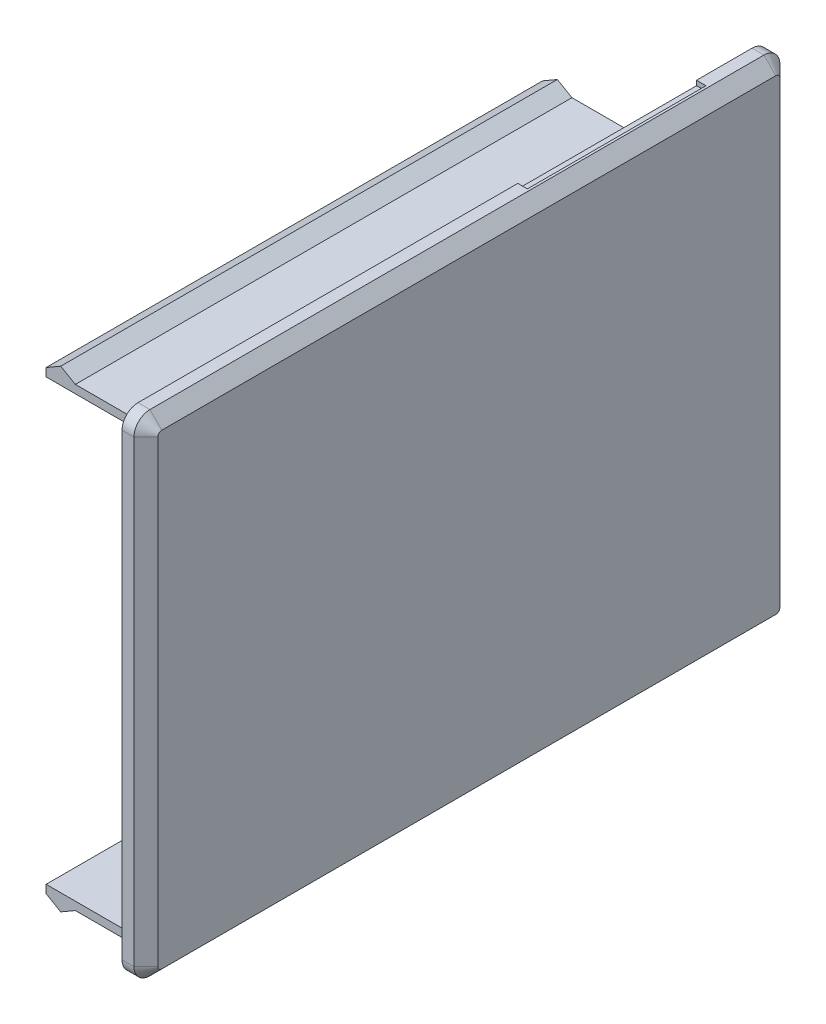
ISO-10303-21;
HEADER;
FILE_DESCRIPTION(('STEP AP214'),'2;1');
FILE_NAME('part.step','',(''),(''),'','','');
FILE_SCHEMA(('AUTOMOTIVE_DESIGN { 1 0 10303 214 1 1 1 1 }'));
ENDSEC;
DATA;
#1=APPLICATION_CONTEXT('core data for automotive mechanical design processes');
#2=APPLICATION_PROTOCOL_DEFINITION('international standard','automotive_design',2000,#1);
#3=PRODUCT_CONTEXT('',#1,'mechanical');
#4=PRODUCT('Part','Part','',(#3));
#5=PRODUCT_RELATED_PRODUCT_CATEGORY('part','',(#4));
#6=PRODUCT_DEFINITION_FORMATION('','',#4);
#7=PRODUCT_DEFINITION_CONTEXT('part definition',#1,'design');
#8=PRODUCT_DEFINITION('design','',#6,#7);
#9=PRODUCT_DEFINITION_SHAPE('','',#8);
#10=(LENGTH_UNIT() NAMED_UNIT(*) SI_UNIT(.MILLI.,.METRE.));
#11=(NAMED_UNIT(*) PLANE_ANGLE_UNIT() SI_UNIT($,.RADIAN.));
#12=(NAMED_UNIT(*) SI_UNIT($,.STERADIAN.) SOLID_ANGLE_UNIT());
#13=UNCERTAINTY_MEASURE_WITH_UNIT(LENGTH_MEASURE(1.E-05),#10,'distance_accuracy_value','');
#14=(GEOMETRIC_REPRESENTATION_CONTEXT(3) GLOBAL_UNCERTAINTY_ASSIGNED_CONTEXT((#13)) GLOBAL_UNIT_ASSIGNED_CONTEXT((#10,
#11,#12)) REPRESENTATION_CONTEXT('',''));
#15=CARTESIAN_POINT('',(0.,0.,0.));
#16=DIRECTION('',(0.,0.,1.));
#17=DIRECTION('',(1.,0.,0.));
#18=AXIS2_PLACEMENT_3D('',#15,#16,#17);
#19=CARTESIAN_POINT('',(0.,0.,0.));
#20=DIRECTION('',(-1.,0.,0.));
#21=DIRECTION('',(0.,0.,1.));
#22=AXIS2_PLACEMENT_3D('',#19,#20,#21);
#23=PLANE('',#22);
#24=DIRECTION('',(0.,0.,-1.));
#25=VECTOR('',#24,1.);
#26=CARTESIAN_POINT('',(0.,50.43,-1.89999999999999));
#27=LINE('',#26,#25);
#28=CARTESIAN_POINT('',(0.,50.43,-1.89999999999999));
#29=VERTEX_POINT('',#28);
#30=CARTESIAN_POINT('',(0.,50.43,-67.539999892));
#31=VERTEX_POINT('',#30);
#32=EDGE_CURVE('E399',#29,#31,#27,.T.);
#33=ORIENTED_EDGE('',*,*,#32,.F.);
#34=DIRECTION('',(0.,1.,0.));
#35=VECTOR('',#34,1.);
#36=CARTESIAN_POINT('',(0.,50.43,-1.89999999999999));
#37=LINE('',#36,#35);
#38=CARTESIAN_POINT('',(0.,1.85,-1.89999999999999));
#39=VERTEX_POINT('',#38);
#40=EDGE_CURVE('E388',#39,#29,#37,.T.);
#41=ORIENTED_EDGE('',*,*,#40,.F.);
#42=DIRECTION('',(0.,0.,1.));
#43=VECTOR('',#42,1.);
#44=CARTESIAN_POINT('',(0.,1.85,-1.89999999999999));
#45=LINE('',#44,#43);
#46=CARTESIAN_POINT('',(0.,1.85,-67.539999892));
#47=VERTEX_POINT('',#46);
#48=EDGE_CURVE('E392',#47,#39,#45,.T.);
#49=ORIENTED_EDGE('',*,*,#48,.F.);
#50=DIRECTION('',(0.,-1.,0.));
#51=VECTOR('',#50,1.);
#52=CARTESIAN_POINT('',(0.,50.43,-67.539999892));
#53=LINE('',#52,#51);
#54=EDGE_CURVE('E403',#31,#47,#53,.T.);
#55=ORIENTED_EDGE('',*,*,#54,.F.);
#56=EDGE_LOOP('',(#33,#41,#49,#55));
#57=FACE_BOUND('',#56,.T.);
#58=DIRECTION('',(0.,0.,-1.));
#59=VECTOR('',#58,1.);
#60=CARTESIAN_POINT('',(0.,0.508000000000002,-42.19));
#61=LINE('',#60,#59);
#62=CARTESIAN_POINT('',(0.,0.508000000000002,-42.19));
#63=VERTEX_POINT('',#62);
#64=CARTESIAN_POINT('',(0.,0.508000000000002,-61.24));
#65=VERTEX_POINT('',#64);
#66=EDGE_CURVE('E562',#63,#65,#61,.T.);
#67=ORIENTED_EDGE('',*,*,#66,.F.);
#68=DIRECTION('',(0.,-1.,0.));
#69=VECTOR('',#68,1.);
#70=CARTESIAN_POINT('',(0.,0.508000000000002,-42.19));
#71=LINE('',#70,#69);
#72=CARTESIAN_POINT('',(0.,0.,-42.19));
#73=VERTEX_POINT('',#72);
#74=EDGE_CURVE('E552',#63,#73,#71,.T.);
#75=ORIENTED_EDGE('',*,*,#74,.T.);
#76=DIRECTION('',(0.,0.,-1.));
#77=VECTOR('',#76,1.);
#78=CARTESIAN_POINT('',(0.,0.,0.));
#79=LINE('',#78,#77);
#80=CARTESIAN_POINT('',(0.,0.,-1.7));
#81=VERTEX_POINT('',#80);
#82=EDGE_CURVE('E422',#81,#73,#79,.T.);
#83=ORIENTED_EDGE('',*,*,#82,.F.);
#84=CARTESIAN_POINT('',(0.,1.7,-1.7));
#85=DIRECTION('',(-1.,0.,0.));
#86=DIRECTION('',(0.,0.,1.));
#87=AXIS2_PLACEMENT_3D('',#84,#85,#86);
#88=CIRCLE('',#87,1.7);
#89=CARTESIAN_POINT('',(0.,1.7,0.));
#90=VERTEX_POINT('',#89);
#91=EDGE_CURVE('E445',#81,#90,#88,.T.);
#92=ORIENTED_EDGE('',*,*,#91,.T.);
#93=DIRECTION('',(0.,-1.,0.));
#94=VECTOR('',#93,1.);
#95=CARTESIAN_POINT('',(0.,0.,0.));
#96=LINE('',#95,#94);
#97=CARTESIAN_POINT('',(0.,50.58,0.));
#98=VERTEX_POINT('',#97);
#99=EDGE_CURVE('E418',#98,#90,#96,.T.);
#100=ORIENTED_EDGE('',*,*,#99,.F.);
#101=CARTESIAN_POINT('',(0.,50.58,-1.7));
#102=DIRECTION('',(-1.,0.,0.));
#103=DIRECTION('',(0.,0.,1.));
#104=AXIS2_PLACEMENT_3D('',#101,#102,#103);
#105=CIRCLE('',#104,1.7);
#106=CARTESIAN_POINT('',(0.,52.28,-1.7));
#107=VERTEX_POINT('',#106);
#108=EDGE_CURVE('E447',#98,#107,#105,.T.);
#109=ORIENTED_EDGE('',*,*,#108,.T.);
#110=DIRECTION('',(0.,0.,1.));
#111=VECTOR('',#110,1.);
#112=CARTESIAN_POINT('',(0.,52.28,0.));
#113=LINE('',#112,#111);
#114=CARTESIAN_POINT('',(0.,52.28,-42.19));
#115=VERTEX_POINT('',#114);
#116=EDGE_CURVE('E430',#115,#107,#113,.T.);
#117=ORIENTED_EDGE('',*,*,#116,.F.);
#118=DIRECTION('',(0.,1.,0.));
#119=VECTOR('',#118,1.);
#120=CARTESIAN_POINT('',(0.,51.772,-42.19));
#121=LINE('',#120,#119);
#122=CARTESIAN_POINT('',(0.,51.772,-42.19));
#123=VERTEX_POINT('',#122);
#124=EDGE_CURVE('E608',#123,#115,#121,.T.);
#125=ORIENTED_EDGE('',*,*,#124,.F.);
#126=DIRECTION('',(0.,0.,-1.));
#127=VECTOR('',#126,1.);
#128=CARTESIAN_POINT('',(0.,51.772,-42.19));
#129=LINE('',#128,#127);
#130=CARTESIAN_POINT('',(0.,51.772,-61.24));
#131=VERTEX_POINT('',#130);
#132=EDGE_CURVE('E634',#123,#131,#129,.T.);
#133=ORIENTED_EDGE('',*,*,#132,.T.);
#134=DIRECTION('',(0.,1.,0.));
#135=VECTOR('',#134,1.);
#136=CARTESIAN_POINT('',(0.,51.772,-61.24));
#137=LINE('',#136,#135);
#138=CARTESIAN_POINT('',(0.,52.28,-61.24));
#139=VERTEX_POINT('',#138);
#140=EDGE_CURVE('E577',#131,#139,#137,.T.);
#141=ORIENTED_EDGE('',*,*,#140,.T.);
#142=CARTESIAN_POINT('',(0.,52.28,-67.16));
#143=VERTEX_POINT('',#142);
#144=EDGE_CURVE('E431',#143,#139,#113,.T.);
#145=ORIENTED_EDGE('',*,*,#144,.F.);
#146=CARTESIAN_POINT('',(0.,50.58,-67.16));
#147=DIRECTION('',(-1.,0.,0.));
#148=DIRECTION('',(0.,0.,1.));
#149=AXIS2_PLACEMENT_3D('',#146,#147,#148);
#150=CIRCLE('',#149,1.7);
#151=CARTESIAN_POINT('',(0.,50.58,-68.86));
#152=VERTEX_POINT('',#151);
#153=EDGE_CURVE('E443',#143,#152,#150,.T.);
#154=ORIENTED_EDGE('',*,*,#153,.T.);
#155=DIRECTION('',(0.,1.,0.));
#156=VECTOR('',#155,1.);
#157=CARTESIAN_POINT('',(0.,0.,-68.86));
#158=LINE('',#157,#156);
#159=CARTESIAN_POINT('',(0.,1.7,-68.86));
#160=VERTEX_POINT('',#159);
#161=EDGE_CURVE('E426',#160,#152,#158,.T.);
#162=ORIENTED_EDGE('',*,*,#161,.F.);
#163=CARTESIAN_POINT('',(0.,1.7,-67.16));
#164=DIRECTION('',(-1.,0.,0.));
#165=DIRECTION('',(0.,0.,1.));
#166=AXIS2_PLACEMENT_3D('',#163,#164,#165);
#167=CIRCLE('',#166,1.7);
#168=CARTESIAN_POINT('',(0.,0.,-67.16));
#169=VERTEX_POINT('',#168);
#170=EDGE_CURVE('E439',#160,#169,#167,.T.);
#171=ORIENTED_EDGE('',*,*,#170,.T.);
#172=CARTESIAN_POINT('',(0.,0.,-61.24));
#173=VERTEX_POINT('',#172);
#174=EDGE_CURVE('E421',#173,#169,#79,.T.);
#175=ORIENTED_EDGE('',*,*,#174,.F.);
#176=DIRECTION('',(0.,-1.,0.));
#177=VECTOR('',#176,1.);
#178=CARTESIAN_POINT('',(0.,0.508000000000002,-61.24));
#179=LINE('',#178,#177);
#180=EDGE_CURVE('E528',#65,#173,#179,.T.);
#181=ORIENTED_EDGE('',*,*,#180,.F.);
#182=EDGE_LOOP('',(#67,#75,#83,#92,#100,#109,#117,#125,#133,#141,#145,#154,#162,#171,#175,#181));
#183=FACE_BOUND('',#182,.T.);
#184=ADVANCED_FACE('F62',(#57,#183),#23,.T.);
#185=CARTESIAN_POINT('',(2.54,0.,0.));
#186=DIRECTION('',(0.,1.,0.));
#187=DIRECTION('',(0.,0.,1.));
#188=AXIS2_PLACEMENT_3D('',#185,#186,#187);
#189=PLANE('',#188);
#190=DIRECTION('',(-1.,0.,0.));
#191=VECTOR('',#190,1.);
#192=CARTESIAN_POINT('',(2.54,0.,-67.16));
#193=LINE('',#192,#191);
#194=CARTESIAN_POINT('',(1.26999999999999,0.,-67.16));
#195=VERTEX_POINT('',#194);
#196=EDGE_CURVE('E454',#169,#195,#193,.F.);
#197=ORIENTED_EDGE('',*,*,#196,.T.);
#198=DIRECTION('',(0.,0.,1.));
#199=VECTOR('',#198,1.);
#200=CARTESIAN_POINT('',(1.26999999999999,0.,0.));
#201=LINE('',#200,#199);
#202=CARTESIAN_POINT('',(1.26999999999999,0.,-1.7));
#203=VERTEX_POINT('',#202);
#204=EDGE_CURVE('E486',#195,#203,#201,.T.);
#205=ORIENTED_EDGE('',*,*,#204,.T.);
#206=DIRECTION('',(-1.,0.,0.));
#207=VECTOR('',#206,1.);
#208=CARTESIAN_POINT('',(2.54,0.,-1.7));
#209=LINE('',#208,#207);
#210=EDGE_CURVE('E458',#203,#81,#209,.T.);
#211=ORIENTED_EDGE('',*,*,#210,.T.);
#212=ORIENTED_EDGE('',*,*,#82,.T.);
#213=DIRECTION('',(1.,0.,0.));
#214=VECTOR('',#213,1.);
#215=CARTESIAN_POINT('',(0.,0.,-42.19));
#216=LINE('',#215,#214);
#217=CARTESIAN_POINT('',(1.016,0.,-42.19));
#218=VERTEX_POINT('',#217);
#219=EDGE_CURVE('E544',#73,#218,#216,.T.);
#220=ORIENTED_EDGE('',*,*,#219,.T.);
#221=DIRECTION('',(0.,0.,-1.));
#222=VECTOR('',#221,1.);
#223=CARTESIAN_POINT('',(1.016,0.,-42.19));
#224=LINE('',#223,#222);
#225=CARTESIAN_POINT('',(1.016,0.,-61.24));
#226=VERTEX_POINT('',#225);
#227=EDGE_CURVE('E553',#218,#226,#224,.T.);
#228=ORIENTED_EDGE('',*,*,#227,.T.);
#229=DIRECTION('',(1.,0.,0.));
#230=VECTOR('',#229,1.);
#231=CARTESIAN_POINT('',(0.,0.,-61.24));
#232=LINE('',#231,#230);
#233=EDGE_CURVE('E549',#173,#226,#232,.T.);
#234=ORIENTED_EDGE('',*,*,#233,.F.);
#235=ORIENTED_EDGE('',*,*,#174,.T.);
#236=EDGE_LOOP('',(#197,#205,#211,#212,#220,#228,#234,#235));
#237=FACE_BOUND('',#236,.T.);
#238=ADVANCED_FACE('F680',(#237),#189,.F.);
#239=CARTESIAN_POINT('',(-0.762,0.,0.));
#240=DIRECTION('',(-1.,0.,0.));
#241=DIRECTION('',(0.,0.,1.));
#242=AXIS2_PLACEMENT_3D('',#239,#240,#241);
#243=PLANE('',#242);
#244=DIRECTION('',(0.,-1.,0.));
#245=VECTOR('',#244,1.);
#246=CARTESIAN_POINT('',(-0.762,50.43,-67.539999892));
#247=LINE('',#246,#245);
#248=CARTESIAN_POINT('',(-0.762,50.43,-67.539999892));
#249=VERTEX_POINT('',#248);
#250=CARTESIAN_POINT('',(-0.762000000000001,2.72000000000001,-67.539999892));
#251=VERTEX_POINT('',#250);
#252=EDGE_CURVE('E391',#249,#251,#247,.T.);
#253=ORIENTED_EDGE('',*,*,#252,.T.);
#254=DIRECTION('',(0.,0.,1.));
#255=VECTOR('',#254,1.);
#256=CARTESIAN_POINT('',(-0.762,2.72000000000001,-76.9405592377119));
#257=LINE('',#256,#255);
#258=CARTESIAN_POINT('',(-0.762,2.72000000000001,-66.669999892));
#259=VERTEX_POINT('',#258);
#260=EDGE_CURVE('E602',#251,#259,#257,.T.);
#261=ORIENTED_EDGE('',*,*,#260,.T.);
#262=DIRECTION('',(0.,-1.,0.));
#263=VECTOR('',#262,1.);
#264=CARTESIAN_POINT('',(-0.762,0.,-66.669999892));
#265=LINE('',#264,#263);
#266=CARTESIAN_POINT('',(-0.762,49.56,-66.669999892));
#267=VERTEX_POINT('',#266);
#268=EDGE_CURVE('E363',#267,#259,#265,.T.);
#269=ORIENTED_EDGE('',*,*,#268,.F.);
#270=DIRECTION('',(0.,0.,-1.));
#271=VECTOR('',#270,1.);
#272=CARTESIAN_POINT('',(-0.762,49.56,-67.539999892));
#273=LINE('',#272,#271);
#274=CARTESIAN_POINT('',(-0.761999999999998,49.56,-54.839999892));
#275=VERTEX_POINT('',#274);
#276=EDGE_CURVE('E331',#275,#267,#273,.T.);
#277=ORIENTED_EDGE('',*,*,#276,.F.);
#278=DIRECTION('',(0.,1.,0.));
#279=VECTOR('',#278,1.);
#280=CARTESIAN_POINT('',(-0.761999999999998,49.56,-54.839999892));
#281=LINE('',#280,#279);
#282=CARTESIAN_POINT('',(-0.761999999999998,50.43,-54.839999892));
#283=VERTEX_POINT('',#282);
#284=EDGE_CURVE('E327',#275,#283,#281,.T.);
#285=ORIENTED_EDGE('',*,*,#284,.T.);
#286=DIRECTION('',(0.,0.,1.));
#287=VECTOR('',#286,1.);
#288=CARTESIAN_POINT('',(-0.761999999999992,50.43,-1.89999999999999));
#289=LINE('',#288,#287);
#290=EDGE_CURVE('E509',#249,#283,#289,.T.);
#291=ORIENTED_EDGE('',*,*,#290,.F.);
#292=EDGE_LOOP('',(#253,#261,#269,#277,#285,#291));
#293=FACE_BOUND('',#292,.T.);
#294=ADVANCED_FACE('F730',(#293),#243,.T.);
#295=DIRECTION('',(0.,1.,0.));
#296=VECTOR('',#295,1.);
#297=CARTESIAN_POINT('',(-0.762,0.,-2.76999999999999));
#298=LINE('',#297,#296);
#299=CARTESIAN_POINT('',(-0.762,2.72,-2.76999999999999));
#300=VERTEX_POINT('',#299);
#301=CARTESIAN_POINT('',(-0.762,49.56,-2.76999999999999));
#302=VERTEX_POINT('',#301);
#303=EDGE_CURVE('E360',#300,#302,#298,.T.);
#304=ORIENTED_EDGE('',*,*,#303,.F.);
#305=CARTESIAN_POINT('',(-0.762,2.72000000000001,-1.89999999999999));
#306=VERTEX_POINT('',#305);
#307=EDGE_CURVE('E588',#300,#306,#257,.T.);
#308=ORIENTED_EDGE('',*,*,#307,.T.);
#309=DIRECTION('',(0.,1.,0.));
#310=VECTOR('',#309,1.);
#311=CARTESIAN_POINT('',(-0.762,50.43,-1.89999999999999));
#312=LINE('',#311,#310);
#313=CARTESIAN_POINT('',(-0.762,49.56,-1.89999999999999));
#314=VERTEX_POINT('',#313);
#315=EDGE_CURVE('E389',#306,#314,#312,.T.);
#316=ORIENTED_EDGE('',*,*,#315,.T.);
#317=DIRECTION('',(0.,0.,1.));
#318=VECTOR('',#317,1.);
#319=CARTESIAN_POINT('',(-0.762,49.56,-76.9405592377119));
#320=LINE('',#319,#318);
#321=EDGE_CURVE('E353',#302,#314,#320,.T.);
#322=ORIENTED_EDGE('',*,*,#321,.F.);
#323=EDGE_LOOP('',(#304,#308,#316,#322));
#324=FACE_BOUND('',#323,.T.);
#325=ADVANCED_FACE('F758',(#324),#243,.T.);
#326=CARTESIAN_POINT('',(2.54,52.28,0.));
#327=DIRECTION('',(0.,-1.,0.));
#328=DIRECTION('',(0.,0.,-1.));
#329=AXIS2_PLACEMENT_3D('',#326,#327,#328);
#330=PLANE('',#329);
#331=DIRECTION('',(-1.,0.,0.));
#332=VECTOR('',#331,1.);
#333=CARTESIAN_POINT('',(2.54,52.28,-1.7));
#334=LINE('',#333,#332);
#335=CARTESIAN_POINT('',(1.26999999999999,52.28,-1.7));
#336=VERTEX_POINT('',#335);
#337=EDGE_CURVE('E452',#107,#336,#334,.F.);
#338=ORIENTED_EDGE('',*,*,#337,.T.);
#339=DIRECTION('',(0.,0.,-1.));
#340=VECTOR('',#339,1.);
#341=CARTESIAN_POINT('',(1.26999999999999,52.28,0.));
#342=LINE('',#341,#340);
#343=CARTESIAN_POINT('',(1.26999999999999,52.28,-67.16));
#344=VERTEX_POINT('',#343);
#345=EDGE_CURVE('E70',#336,#344,#342,.T.);
#346=ORIENTED_EDGE('',*,*,#345,.T.);
#347=DIRECTION('',(-1.,0.,0.));
#348=VECTOR('',#347,1.);
#349=CARTESIAN_POINT('',(2.54,52.28,-67.16));
#350=LINE('',#349,#348);
#351=EDGE_CURVE('E450',#344,#143,#350,.T.);
#352=ORIENTED_EDGE('',*,*,#351,.T.);
#353=ORIENTED_EDGE('',*,*,#144,.T.);
#354=DIRECTION('',(1.,0.,0.));
#355=VECTOR('',#354,1.);
#356=CARTESIAN_POINT('',(0.,52.28,-61.24));
#357=LINE('',#356,#355);
#358=CARTESIAN_POINT('',(1.016,52.28,-61.24));
#359=VERTEX_POINT('',#358);
#360=EDGE_CURVE('E626',#139,#359,#357,.T.);
#361=ORIENTED_EDGE('',*,*,#360,.T.);
#362=DIRECTION('',(0.,0.,-1.));
#363=VECTOR('',#362,1.);
#364=CARTESIAN_POINT('',(1.016,52.28,-42.19));
#365=LINE('',#364,#363);
#366=CARTESIAN_POINT('',(1.016,52.28,-42.19));
#367=VERTEX_POINT('',#366);
#368=EDGE_CURVE('E623',#367,#359,#365,.T.);
#369=ORIENTED_EDGE('',*,*,#368,.F.);
#370=DIRECTION('',(1.,0.,0.));
#371=VECTOR('',#370,1.);
#372=CARTESIAN_POINT('',(0.,52.28,-42.19));
#373=LINE('',#372,#371);
#374=EDGE_CURVE('E611',#115,#367,#373,.T.);
#375=ORIENTED_EDGE('',*,*,#374,.F.);
#376=ORIENTED_EDGE('',*,*,#116,.T.);
#377=EDGE_LOOP('',(#338,#346,#352,#353,#361,#369,#375,#376));
#378=FACE_BOUND('',#377,.T.);
#379=ADVANCED_FACE('F702',(#378),#330,.F.);
#380=CARTESIAN_POINT('',(2.54,0.,0.));
#381=DIRECTION('',(0.,0.,-1.));
#382=DIRECTION('',(-1.,0.,0.));
#383=AXIS2_PLACEMENT_3D('',#380,#381,#382);
#384=PLANE('',#383);
#385=DIRECTION('',(-1.,0.,0.));
#386=VECTOR('',#385,1.);
#387=CARTESIAN_POINT('',(2.54,1.7,0.));
#388=LINE('',#387,#386);
#389=CARTESIAN_POINT('',(1.26999999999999,1.7,0.));
#390=VERTEX_POINT('',#389);
#391=EDGE_CURVE('E434',#90,#390,#388,.F.);
#392=ORIENTED_EDGE('',*,*,#391,.T.);
#393=DIRECTION('',(0.,1.,0.));
#394=VECTOR('',#393,1.);
#395=CARTESIAN_POINT('',(1.26999999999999,0.,0.));
#396=LINE('',#395,#394);
#397=CARTESIAN_POINT('',(1.26999999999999,50.58,0.));
#398=VERTEX_POINT('',#397);
#399=EDGE_CURVE('E498',#390,#398,#396,.T.);
#400=ORIENTED_EDGE('',*,*,#399,.T.);
#401=DIRECTION('',(-1.,0.,0.));
#402=VECTOR('',#401,1.);
#403=CARTESIAN_POINT('',(2.54,50.58,0.));
#404=LINE('',#403,#402);
#405=EDGE_CURVE('E437',#398,#98,#404,.T.);
#406=ORIENTED_EDGE('',*,*,#405,.T.);
#407=ORIENTED_EDGE('',*,*,#99,.T.);
#408=EDGE_LOOP('',(#392,#400,#406,#407));
#409=FACE_BOUND('',#408,.T.);
#410=ADVANCED_FACE('F810',(#409),#384,.F.);
#411=CARTESIAN_POINT('',(2.54,0.,-68.86));
#412=DIRECTION('',(0.,0.,1.));
#413=DIRECTION('',(1.,0.,0.));
#414=AXIS2_PLACEMENT_3D('',#411,#412,#413);
#415=PLANE('',#414);
#416=DIRECTION('',(-1.,0.,0.));
#417=VECTOR('',#416,1.);
#418=CARTESIAN_POINT('',(2.54,50.58,-68.86));
#419=LINE('',#418,#417);
#420=CARTESIAN_POINT('',(1.26999999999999,50.58,-68.86));
#421=VERTEX_POINT('',#420);
#422=EDGE_CURVE('E463',#152,#421,#419,.F.);
#423=ORIENTED_EDGE('',*,*,#422,.T.);
#424=DIRECTION('',(0.,-1.,0.));
#425=VECTOR('',#424,1.);
#426=CARTESIAN_POINT('',(1.26999999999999,0.,-68.86));
#427=LINE('',#426,#425);
#428=CARTESIAN_POINT('',(1.26999999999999,1.7,-68.86));
#429=VERTEX_POINT('',#428);
#430=EDGE_CURVE('E495',#421,#429,#427,.T.);
#431=ORIENTED_EDGE('',*,*,#430,.T.);
#432=DIRECTION('',(-1.,0.,0.));
#433=VECTOR('',#432,1.);
#434=CARTESIAN_POINT('',(2.54,1.7,-68.86));
#435=LINE('',#434,#433);
#436=EDGE_CURVE('E460',#429,#160,#435,.T.);
#437=ORIENTED_EDGE('',*,*,#436,.T.);
#438=ORIENTED_EDGE('',*,*,#161,.T.);
#439=EDGE_LOOP('',(#423,#431,#437,#438));
#440=FACE_BOUND('',#439,.T.);
#441=ADVANCED_FACE('F805',(#440),#415,.F.);
#442=CARTESIAN_POINT('',(2.54,0.,0.));
#443=DIRECTION('',(-1.,0.,0.));
#444=DIRECTION('',(0.,0.,1.));
#445=AXIS2_PLACEMENT_3D('',#442,#443,#444);
#446=PLANE('',#445);
#447=CARTESIAN_POINT('',(2.54,1.7,-1.7));
#448=DIRECTION('',(-1.,0.,0.));
#449=DIRECTION('',(0.,0.,1.));
#450=AXIS2_PLACEMENT_3D('',#447,#448,#449);
#451=CIRCLE('',#450,0.43);
#452=CARTESIAN_POINT('',(2.54,1.7,-1.27));
#453=VERTEX_POINT('',#452);
#454=CARTESIAN_POINT('',(2.54,1.27,-1.7));
#455=VERTEX_POINT('',#454);
#456=EDGE_CURVE('E477',#453,#455,#451,.F.);
#457=ORIENTED_EDGE('',*,*,#456,.T.);
#458=DIRECTION('',(0.,0.,-1.));
#459=VECTOR('',#458,1.);
#460=CARTESIAN_POINT('',(2.54,1.27,0.));
#461=LINE('',#460,#459);
#462=CARTESIAN_POINT('',(2.54,1.27,-67.16));
#463=VERTEX_POINT('',#462);
#464=EDGE_CURVE('E482',#455,#463,#461,.T.);
#465=ORIENTED_EDGE('',*,*,#464,.T.);
#466=CARTESIAN_POINT('',(2.54,1.7,-67.16));
#467=DIRECTION('',(-1.,0.,0.));
#468=DIRECTION('',(0.,0.,1.));
#469=AXIS2_PLACEMENT_3D('',#466,#467,#468);
#470=CIRCLE('',#469,0.43);
#471=CARTESIAN_POINT('',(2.54,1.7,-67.59));
#472=VERTEX_POINT('',#471);
#473=EDGE_CURVE('E479',#463,#472,#470,.F.);
#474=ORIENTED_EDGE('',*,*,#473,.T.);
#475=DIRECTION('',(0.,1.,0.));
#476=VECTOR('',#475,1.);
#477=CARTESIAN_POINT('',(2.54,0.,-67.59));
#478=LINE('',#477,#476);
#479=CARTESIAN_POINT('',(2.54,50.58,-67.59));
#480=VERTEX_POINT('',#479);
#481=EDGE_CURVE('E474',#472,#480,#478,.T.);
#482=ORIENTED_EDGE('',*,*,#481,.T.);
#483=CARTESIAN_POINT('',(2.54,50.58,-67.16));
#484=DIRECTION('',(-1.,0.,0.));
#485=DIRECTION('',(0.,0.,1.));
#486=AXIS2_PLACEMENT_3D('',#483,#484,#485);
#487=CIRCLE('',#486,0.43);
#488=CARTESIAN_POINT('',(2.54,51.01,-67.16));
#489=VERTEX_POINT('',#488);
#490=EDGE_CURVE('E470',#480,#489,#487,.F.);
#491=ORIENTED_EDGE('',*,*,#490,.T.);
#492=DIRECTION('',(0.,0.,1.));
#493=VECTOR('',#492,1.);
#494=CARTESIAN_POINT('',(2.54,51.01,0.));
#495=LINE('',#494,#493);
#496=CARTESIAN_POINT('',(2.54,51.01,-1.7));
#497=VERTEX_POINT('',#496);
#498=EDGE_CURVE('E466',#489,#497,#495,.T.);
#499=ORIENTED_EDGE('',*,*,#498,.T.);
#500=CARTESIAN_POINT('',(2.54,50.58,-1.7));
#501=DIRECTION('',(-1.,0.,0.));
#502=DIRECTION('',(0.,0.,1.));
#503=AXIS2_PLACEMENT_3D('',#500,#501,#502);
#504=CIRCLE('',#503,0.43);
#505=CARTESIAN_POINT('',(2.54,50.58,-1.27));
#506=VERTEX_POINT('',#505);
#507=EDGE_CURVE('E468',#497,#506,#504,.F.);
#508=ORIENTED_EDGE('',*,*,#507,.T.);
#509=DIRECTION('',(0.,-1.,0.));
#510=VECTOR('',#509,1.);
#511=CARTESIAN_POINT('',(2.54,0.,-1.27));
#512=LINE('',#511,#510);
#513=EDGE_CURVE('E472',#506,#453,#512,.T.);
#514=ORIENTED_EDGE('',*,*,#513,.T.);
#515=EDGE_LOOP('',(#457,#465,#474,#482,#491,#499,#508,#514));
#516=FACE_BOUND('',#515,.T.);
#517=ADVANCED_FACE('F803',(#516),#446,.F.);
#518=CARTESIAN_POINT('',(-0.762,50.43,-1.89999999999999));
#519=DIRECTION('',(0.,0.,-1.));
#520=DIRECTION('',(0.,1.,0.));
#521=AXIS2_PLACEMENT_3D('',#518,#519,#520);
#522=PLANE('',#521);
#523=ORIENTED_EDGE('',*,*,#40,.T.);
#524=DIRECTION('',(1.,0.,0.));
#525=VECTOR('',#524,1.);
#526=CARTESIAN_POINT('',(-0.762,50.43,-1.89999999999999));
#527=LINE('',#526,#525);
#528=CARTESIAN_POINT('',(-6.8766896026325,50.43,-1.89999999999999));
#529=VERTEX_POINT('',#528);
#530=EDGE_CURVE('E416',#529,#29,#527,.T.);
#531=ORIENTED_EDGE('',*,*,#530,.F.);
#532=DIRECTION('',(-0.866025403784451,0.499999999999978,0.));
#533=VECTOR('',#532,1.);
#534=CARTESIAN_POINT('',(-6.8766896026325,50.43,-1.89999999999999));
#535=LINE('',#534,#533);
#536=CARTESIAN_POINT('',(-8.43555472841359,51.3300112,-1.89999999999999));
#537=VERTEX_POINT('',#536);
#538=EDGE_CURVE('E638',#529,#537,#535,.T.);
#539=ORIENTED_EDGE('',*,*,#538,.T.);
#540=DIRECTION('',(-0.866025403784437,-0.500000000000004,0.));
#541=VECTOR('',#540,1.);
#542=CARTESIAN_POINT('',(-8.43555472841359,51.3300112,-1.89999999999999));
#543=LINE('',#542,#541);
#544=CARTESIAN_POINT('',(-9.9944198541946,50.43,-1.89999999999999));
#545=VERTEX_POINT('',#544);
#546=EDGE_CURVE('E645',#537,#545,#543,.T.);
#547=ORIENTED_EDGE('',*,*,#546,.T.);
#548=DIRECTION('',(0.,-1.,0.));
#549=VECTOR('',#548,1.);
#550=CARTESIAN_POINT('',(-9.9944198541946,50.43,-1.89999999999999));
#551=LINE('',#550,#549);
#552=CARTESIAN_POINT('',(-9.99441985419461,49.56,-1.89999999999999));
#553=VERTEX_POINT('',#552);
#554=EDGE_CURVE('E648',#545,#553,#551,.T.);
#555=ORIENTED_EDGE('',*,*,#554,.T.);
#556=DIRECTION('',(1.,0.,0.));
#557=VECTOR('',#556,1.);
#558=CARTESIAN_POINT('',(-9.99441985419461,49.56,-1.89999999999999));
#559=LINE('',#558,#557);
#560=EDGE_CURVE('E345',#553,#314,#559,.T.);
#561=ORIENTED_EDGE('',*,*,#560,.T.);
#562=ORIENTED_EDGE('',*,*,#315,.F.);
#563=DIRECTION('',(1.,0.,0.));
#564=VECTOR('',#563,1.);
#565=CARTESIAN_POINT('',(-9.99441985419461,2.72000000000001,-1.89999999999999));
#566=LINE('',#565,#564);
#567=CARTESIAN_POINT('',(-9.99441985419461,2.72000000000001,-1.89999999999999));
#568=VERTEX_POINT('',#567);
#569=EDGE_CURVE('E557',#568,#306,#566,.T.);
#570=ORIENTED_EDGE('',*,*,#569,.F.);
#571=DIRECTION('',(0.,1.,0.));
#572=VECTOR('',#571,1.);
#573=CARTESIAN_POINT('',(-9.9944198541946,1.85000000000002,-1.89999999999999));
#574=LINE('',#573,#572);
#575=CARTESIAN_POINT('',(-9.9944198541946,1.85000000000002,-1.89999999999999));
#576=VERTEX_POINT('',#575);
#577=EDGE_CURVE('E579',#576,#568,#574,.T.);
#578=ORIENTED_EDGE('',*,*,#577,.F.);
#579=DIRECTION('',(-0.866025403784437,0.500000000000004,0.));
#580=VECTOR('',#579,1.);
#581=CARTESIAN_POINT('',(-8.43555472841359,0.949988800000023,-1.89999999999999));
#582=LINE('',#581,#580);
#583=CARTESIAN_POINT('',(-8.43555472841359,0.949988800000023,-1.89999999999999));
#584=VERTEX_POINT('',#583);
#585=EDGE_CURVE('E582',#584,#576,#582,.T.);
#586=ORIENTED_EDGE('',*,*,#585,.F.);
#587=DIRECTION('',(-0.866025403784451,-0.499999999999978,0.));
#588=VECTOR('',#587,1.);
#589=CARTESIAN_POINT('',(-6.8766896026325,1.85,-1.89999999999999));
#590=LINE('',#589,#588);
#591=CARTESIAN_POINT('',(-6.8766896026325,1.85,-1.89999999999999));
#592=VERTEX_POINT('',#591);
#593=EDGE_CURVE('E585',#592,#584,#590,.T.);
#594=ORIENTED_EDGE('',*,*,#593,.F.);
#595=DIRECTION('',(1.,0.,0.));
#596=VECTOR('',#595,1.);
#597=CARTESIAN_POINT('',(-0.762,1.85,-1.89999999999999));
#598=LINE('',#597,#596);
#599=EDGE_CURVE('E396',#592,#39,#598,.T.);
#600=ORIENTED_EDGE('',*,*,#599,.T.);
#601=EDGE_LOOP('',(#523,#531,#539,#547,#555,#561,#562,#570,#578,#586,#594,#600));
#602=FACE_BOUND('',#601,.T.);
#603=ADVANCED_FACE('F651',(#602),#522,.F.);
#604=CARTESIAN_POINT('',(-0.762,50.43,-1.89999999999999));
#605=DIRECTION('',(0.,-1.,0.));
#606=DIRECTION('',(0.,0.,-1.));
#607=AXIS2_PLACEMENT_3D('',#604,#605,#606);
#608=PLANE('',#607);
#609=DIRECTION('',(1.,0.,0.));
#610=VECTOR('',#609,1.);
#611=CARTESIAN_POINT('',(-0.762,50.43,-67.539999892));
#612=LINE('',#611,#610);
#613=EDGE_CURVE('E414',#249,#31,#612,.T.);
#614=ORIENTED_EDGE('',*,*,#613,.F.);
#615=ORIENTED_EDGE('',*,*,#290,.T.);
#616=DIRECTION('',(-1.,0.,0.));
#617=VECTOR('',#616,1.);
#618=CARTESIAN_POINT('',(-0.762,50.43,-54.839999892));
#619=LINE('',#618,#617);
#620=CARTESIAN_POINT('',(-6.8766896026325,50.43,-54.839999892));
#621=VERTEX_POINT('',#620);
#622=EDGE_CURVE('E659',#283,#621,#619,.T.);
#623=ORIENTED_EDGE('',*,*,#622,.T.);
#624=DIRECTION('',(0.,0.,1.));
#625=VECTOR('',#624,1.);
#626=CARTESIAN_POINT('',(-6.8766896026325,50.43,-76.9405592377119));
#627=LINE('',#626,#625);
#628=EDGE_CURVE('E357',#621,#529,#627,.T.);
#629=ORIENTED_EDGE('',*,*,#628,.T.);
#630=ORIENTED_EDGE('',*,*,#530,.T.);
#631=ORIENTED_EDGE('',*,*,#32,.T.);
#632=EDGE_LOOP('',(#614,#615,#623,#629,#630,#631));
#633=FACE_BOUND('',#632,.T.);
#634=ADVANCED_FACE('F778',(#633),#608,.F.);
#635=CARTESIAN_POINT('',(-0.762,50.43,-67.539999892));
#636=DIRECTION('',(0.,0.,1.));
#637=DIRECTION('',(1.,0.,0.));
#638=AXIS2_PLACEMENT_3D('',#635,#636,#637);
#639=PLANE('',#638);
#640=ORIENTED_EDGE('',*,*,#252,.F.);
#641=ORIENTED_EDGE('',*,*,#613,.T.);
#642=ORIENTED_EDGE('',*,*,#54,.T.);
#643=DIRECTION('',(1.,0.,0.));
#644=VECTOR('',#643,1.);
#645=CARTESIAN_POINT('',(-0.762,1.85,-67.539999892));
#646=LINE('',#645,#644);
#647=CARTESIAN_POINT('',(-6.8766896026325,1.85,-67.539999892));
#648=VERTEX_POINT('',#647);
#649=EDGE_CURVE('E411',#648,#47,#646,.T.);
#650=ORIENTED_EDGE('',*,*,#649,.F.);
#651=DIRECTION('',(0.866025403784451,0.499999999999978,0.));
#652=VECTOR('',#651,1.);
#653=CARTESIAN_POINT('',(-6.8766896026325,1.85,-67.539999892));
#654=LINE('',#653,#652);
#655=CARTESIAN_POINT('',(-8.43555472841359,0.949988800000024,-67.539999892));
#656=VERTEX_POINT('',#655);
#657=EDGE_CURVE('E573',#656,#648,#654,.T.);
#658=ORIENTED_EDGE('',*,*,#657,.F.);
#659=DIRECTION('',(0.866025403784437,-0.500000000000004,0.));
#660=VECTOR('',#659,1.);
#661=CARTESIAN_POINT('',(-8.43555472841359,0.949988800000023,-67.539999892));
#662=LINE('',#661,#660);
#663=CARTESIAN_POINT('',(-9.9944198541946,1.85000000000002,-67.539999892));
#664=VERTEX_POINT('',#663);
#665=EDGE_CURVE('E569',#664,#656,#662,.T.);
#666=ORIENTED_EDGE('',*,*,#665,.F.);
#667=DIRECTION('',(0.,-1.,0.));
#668=VECTOR('',#667,1.);
#669=CARTESIAN_POINT('',(-9.9944198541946,1.85000000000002,-67.539999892));
#670=LINE('',#669,#668);
#671=CARTESIAN_POINT('',(-9.99441985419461,2.72000000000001,-67.539999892));
#672=VERTEX_POINT('',#671);
#673=EDGE_CURVE('E565',#672,#664,#670,.T.);
#674=ORIENTED_EDGE('',*,*,#673,.F.);
#675=DIRECTION('',(-1.,0.,0.));
#676=VECTOR('',#675,1.);
#677=CARTESIAN_POINT('',(-9.99441985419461,2.72000000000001,-67.539999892));
#678=LINE('',#677,#676);
#679=EDGE_CURVE('E570',#251,#672,#678,.T.);
#680=ORIENTED_EDGE('',*,*,#679,.F.);
#681=EDGE_LOOP('',(#640,#641,#642,#650,#658,#666,#674,#680));
#682=FACE_BOUND('',#681,.T.);
#683=ADVANCED_FACE('F788',(#682),#639,.F.);
#684=CARTESIAN_POINT('',(-0.762,1.85,-1.89999999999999));
#685=DIRECTION('',(0.,1.,0.));
#686=DIRECTION('',(0.,0.,1.));
#687=AXIS2_PLACEMENT_3D('',#684,#685,#686);
#688=PLANE('',#687);
#689=ORIENTED_EDGE('',*,*,#48,.T.);
#690=ORIENTED_EDGE('',*,*,#599,.F.);
#691=DIRECTION('',(0.,0.,1.));
#692=VECTOR('',#691,1.);
#693=CARTESIAN_POINT('',(-6.8766896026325,1.85,-76.9405592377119));
#694=LINE('',#693,#692);
#695=EDGE_CURVE('E589',#648,#592,#694,.T.);
#696=ORIENTED_EDGE('',*,*,#695,.F.);
#697=ORIENTED_EDGE('',*,*,#649,.T.);
#698=EDGE_LOOP('',(#689,#690,#696,#697));
#699=FACE_BOUND('',#698,.T.);
#700=ADVANCED_FACE('F789',(#699),#688,.F.);
#701=CARTESIAN_POINT('',(-0.762,0.,-2.76999999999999));
#702=DIRECTION('',(0.,0.,-1.));
#703=DIRECTION('',(0.,1.,0.));
#704=AXIS2_PLACEMENT_3D('',#701,#702,#703);
#705=PLANE('',#704);
#706=DIRECTION('',(0.,1.,0.));
#707=VECTOR('',#706,1.);
#708=CARTESIAN_POINT('',(0.,0.,-2.76999999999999));
#709=LINE('',#708,#707);
#710=CARTESIAN_POINT('',(0.,2.72,-2.76999999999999));
#711=VERTEX_POINT('',#710);
#712=CARTESIAN_POINT('',(0.,49.56,-2.76999999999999));
#713=VERTEX_POINT('',#712);
#714=EDGE_CURVE('E346',#711,#713,#709,.T.);
#715=ORIENTED_EDGE('',*,*,#714,.F.);
#716=DIRECTION('',(1.,0.,0.));
#717=VECTOR('',#716,1.);
#718=CARTESIAN_POINT('',(-0.762,2.72,-2.76999999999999));
#719=LINE('',#718,#717);
#720=EDGE_CURVE('E367',#300,#711,#719,.T.);
#721=ORIENTED_EDGE('',*,*,#720,.F.);
#722=ORIENTED_EDGE('',*,*,#303,.T.);
#723=DIRECTION('',(1.,0.,0.));
#724=VECTOR('',#723,1.);
#725=CARTESIAN_POINT('',(-0.762,49.56,-2.76999999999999));
#726=LINE('',#725,#724);
#727=EDGE_CURVE('E385',#302,#713,#726,.T.);
#728=ORIENTED_EDGE('',*,*,#727,.T.);
#729=EDGE_LOOP('',(#715,#721,#722,#728));
#730=FACE_BOUND('',#729,.T.);
#731=ADVANCED_FACE('F754',(#730),#705,.T.);
#732=CARTESIAN_POINT('',(-0.762,49.56,0.));
#733=DIRECTION('',(0.,-1.,0.));
#734=DIRECTION('',(0.,0.,-1.));
#735=AXIS2_PLACEMENT_3D('',#732,#733,#734);
#736=PLANE('',#735);
#737=ORIENTED_EDGE('',*,*,#276,.T.);
#738=DIRECTION('',(1.,0.,0.));
#739=VECTOR('',#738,1.);
#740=CARTESIAN_POINT('',(-0.762,49.56,-66.669999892));
#741=LINE('',#740,#739);
#742=CARTESIAN_POINT('',(0.,49.56,-66.669999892));
#743=VERTEX_POINT('',#742);
#744=EDGE_CURVE('E382',#267,#743,#741,.T.);
#745=ORIENTED_EDGE('',*,*,#744,.T.);
#746=DIRECTION('',(0.,0.,-1.));
#747=VECTOR('',#746,1.);
#748=CARTESIAN_POINT('',(0.,49.56,0.));
#749=LINE('',#748,#747);
#750=EDGE_CURVE('E348',#713,#743,#749,.T.);
#751=ORIENTED_EDGE('',*,*,#750,.F.);
#752=ORIENTED_EDGE('',*,*,#727,.F.);
#753=ORIENTED_EDGE('',*,*,#321,.T.);
#754=ORIENTED_EDGE('',*,*,#560,.F.);
#755=DIRECTION('',(0.,0.,1.));
#756=VECTOR('',#755,1.);
#757=CARTESIAN_POINT('',(-9.99441985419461,49.56,-76.9405592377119));
#758=LINE('',#757,#756);
#759=CARTESIAN_POINT('',(-9.9944198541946,49.56,-54.839999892));
#760=VERTEX_POINT('',#759);
#761=EDGE_CURVE('E337',#760,#553,#758,.T.);
#762=ORIENTED_EDGE('',*,*,#761,.F.);
#763=DIRECTION('',(1.,0.,0.));
#764=VECTOR('',#763,1.);
#765=CARTESIAN_POINT('',(-0.761999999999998,49.56,-54.839999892));
#766=LINE('',#765,#764);
#767=EDGE_CURVE('E322',#760,#275,#766,.T.);
#768=ORIENTED_EDGE('',*,*,#767,.T.);
#769=EDGE_LOOP('',(#737,#745,#751,#752,#753,#754,#762,#768));
#770=FACE_BOUND('',#769,.T.);
#771=ADVANCED_FACE('F342',(#770),#736,.T.);
#772=CARTESIAN_POINT('',(-0.762,0.,-66.669999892));
#773=DIRECTION('',(0.,0.,1.));
#774=DIRECTION('',(1.,0.,0.));
#775=AXIS2_PLACEMENT_3D('',#772,#773,#774);
#776=PLANE('',#775);
#777=DIRECTION('',(0.,-1.,0.));
#778=VECTOR('',#777,1.);
#779=CARTESIAN_POINT('',(0.,0.,-66.669999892));
#780=LINE('',#779,#778);
#781=CARTESIAN_POINT('',(0.,2.72,-66.669999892));
#782=VERTEX_POINT('',#781);
#783=EDGE_CURVE('E371',#743,#782,#780,.T.);
#784=ORIENTED_EDGE('',*,*,#783,.F.);
#785=ORIENTED_EDGE('',*,*,#744,.F.);
#786=ORIENTED_EDGE('',*,*,#268,.T.);
#787=DIRECTION('',(1.,0.,0.));
#788=VECTOR('',#787,1.);
#789=CARTESIAN_POINT('',(-0.762,2.72,-66.669999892));
#790=LINE('',#789,#788);
#791=EDGE_CURVE('E378',#259,#782,#790,.T.);
#792=ORIENTED_EDGE('',*,*,#791,.T.);
#793=EDGE_LOOP('',(#784,#785,#786,#792));
#794=FACE_BOUND('',#793,.T.);
#795=ADVANCED_FACE('F743',(#794),#776,.T.);
#796=CARTESIAN_POINT('',(-0.762,2.72,0.));
#797=DIRECTION('',(0.,1.,0.));
#798=DIRECTION('',(0.,0.,1.));
#799=AXIS2_PLACEMENT_3D('',#796,#797,#798);
#800=PLANE('',#799);
#801=DIRECTION('',(0.,0.,1.));
#802=VECTOR('',#801,1.);
#803=CARTESIAN_POINT('',(0.,2.72,0.));
#804=LINE('',#803,#802);
#805=EDGE_CURVE('E364',#782,#711,#804,.T.);
#806=ORIENTED_EDGE('',*,*,#805,.F.);
#807=ORIENTED_EDGE('',*,*,#791,.F.);
#808=ORIENTED_EDGE('',*,*,#260,.F.);
#809=ORIENTED_EDGE('',*,*,#679,.T.);
#810=DIRECTION('',(0.,0.,1.));
#811=VECTOR('',#810,1.);
#812=CARTESIAN_POINT('',(-9.99441985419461,2.72000000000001,-76.9405592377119));
#813=LINE('',#812,#811);
#814=EDGE_CURVE('E599',#672,#568,#813,.T.);
#815=ORIENTED_EDGE('',*,*,#814,.T.);
#816=ORIENTED_EDGE('',*,*,#569,.T.);
#817=ORIENTED_EDGE('',*,*,#307,.F.);
#818=ORIENTED_EDGE('',*,*,#720,.T.);
#819=EDGE_LOOP('',(#806,#807,#808,#809,#815,#816,#817,#818));
#820=FACE_BOUND('',#819,.T.);
#821=ADVANCED_FACE('F736',(#820),#800,.T.);
#822=ORIENTED_EDGE('',*,*,#714,.T.);
#823=ORIENTED_EDGE('',*,*,#750,.T.);
#824=ORIENTED_EDGE('',*,*,#783,.T.);
#825=ORIENTED_EDGE('',*,*,#805,.T.);
#826=EDGE_LOOP('',(#822,#823,#824,#825));
#827=FACE_BOUND('',#826,.T.);
#828=ADVANCED_FACE('F726',(#827),#23,.T.);
#829=CARTESIAN_POINT('',(-9.9944198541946,50.43,-76.9405592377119));
#830=DIRECTION('',(-1.,0.,0.));
#831=DIRECTION('',(0.,-1.,0.));
#832=AXIS2_PLACEMENT_3D('',#829,#830,#831);
#833=PLANE('',#832);
#834=DIRECTION('',(0.,1.,0.));
#835=VECTOR('',#834,1.);
#836=CARTESIAN_POINT('',(-9.9944198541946,49.56,-54.839999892));
#837=LINE('',#836,#835);
#838=CARTESIAN_POINT('',(-9.9944198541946,50.43,-54.839999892));
#839=VERTEX_POINT('',#838);
#840=EDGE_CURVE('E325',#760,#839,#837,.T.);
#841=ORIENTED_EDGE('',*,*,#840,.F.);
#842=ORIENTED_EDGE('',*,*,#761,.T.);
#843=ORIENTED_EDGE('',*,*,#554,.F.);
#844=DIRECTION('',(0.,0.,1.));
#845=VECTOR('',#844,1.);
#846=CARTESIAN_POINT('',(-9.9944198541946,50.43,-76.9405592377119));
#847=LINE('',#846,#845);
#848=EDGE_CURVE('E339',#839,#545,#847,.T.);
#849=ORIENTED_EDGE('',*,*,#848,.F.);
#850=EDGE_LOOP('',(#841,#842,#843,#849));
#851=FACE_BOUND('',#850,.T.);
#852=ADVANCED_FACE('F335',(#851),#833,.T.);
#853=CARTESIAN_POINT('',(-8.43555472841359,51.3300112,-76.9405592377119));
#854=DIRECTION('',(-0.500000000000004,0.866025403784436,0.));
#855=DIRECTION('',(-0.866025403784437,-0.500000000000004,0.));
#856=AXIS2_PLACEMENT_3D('',#853,#854,#855);
#857=PLANE('',#856);
#858=DIRECTION('',(0.866025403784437,0.500000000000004,0.));
#859=VECTOR('',#858,1.);
#860=CARTESIAN_POINT('',(-8.43555472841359,51.3300112,-54.839999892));
#861=LINE('',#860,#859);
#862=CARTESIAN_POINT('',(-8.43555472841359,51.3300112,-54.839999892));
#863=VERTEX_POINT('',#862);
#864=EDGE_CURVE('E76',#839,#863,#861,.T.);
#865=ORIENTED_EDGE('',*,*,#864,.F.);
#866=ORIENTED_EDGE('',*,*,#848,.T.);
#867=ORIENTED_EDGE('',*,*,#546,.F.);
#868=DIRECTION('',(0.,0.,1.));
#869=VECTOR('',#868,1.);
#870=CARTESIAN_POINT('',(-8.43555472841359,51.3300112,-76.9405592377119));
#871=LINE('',#870,#869);
#872=EDGE_CURVE('E350',#863,#537,#871,.T.);
#873=ORIENTED_EDGE('',*,*,#872,.F.);
#874=EDGE_LOOP('',(#865,#866,#867,#873));
#875=FACE_BOUND('',#874,.T.);
#876=ADVANCED_FACE('F658',(#875),#857,.T.);
#877=CARTESIAN_POINT('',(-6.8766896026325,50.43,-76.9405592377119));
#878=DIRECTION('',(0.499999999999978,0.866025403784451,0.));
#879=DIRECTION('',(-0.866025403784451,0.499999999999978,0.));
#880=AXIS2_PLACEMENT_3D('',#877,#878,#879);
#881=PLANE('',#880);
#882=DIRECTION('',(0.866025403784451,-0.499999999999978,0.));
#883=VECTOR('',#882,1.);
#884=CARTESIAN_POINT('',(-6.8766896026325,50.43,-54.839999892));
#885=LINE('',#884,#883);
#886=EDGE_CURVE('E12',#863,#621,#885,.T.);
#887=ORIENTED_EDGE('',*,*,#886,.F.);
#888=ORIENTED_EDGE('',*,*,#872,.T.);
#889=ORIENTED_EDGE('',*,*,#538,.F.);
#890=ORIENTED_EDGE('',*,*,#628,.F.);
#891=EDGE_LOOP('',(#887,#888,#889,#890));
#892=FACE_BOUND('',#891,.T.);
#893=ADVANCED_FACE('F711',(#892),#881,.T.);
#894=CARTESIAN_POINT('',(2.54,50.58,-1.7));
#895=DIRECTION('',(-1.,0.,0.));
#896=DIRECTION('',(0.,0.,1.));
#897=AXIS2_PLACEMENT_3D('',#894,#895,#896);
#898=CYLINDRICAL_SURFACE('',#897,1.7);
#899=ORIENTED_EDGE('',*,*,#405,.F.);
#900=CARTESIAN_POINT('',(1.26999999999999,50.58,-1.7));
#901=DIRECTION('',(-1.,0.,0.));
#902=DIRECTION('',(0.,0.,1.));
#903=AXIS2_PLACEMENT_3D('',#900,#901,#902);
#904=CIRCLE('',#903,1.7);
#905=EDGE_CURVE('E84',#398,#336,#904,.T.);
#906=ORIENTED_EDGE('',*,*,#905,.T.);
#907=ORIENTED_EDGE('',*,*,#337,.F.);
#908=ORIENTED_EDGE('',*,*,#108,.F.);
#909=EDGE_LOOP('',(#899,#906,#907,#908));
#910=FACE_BOUND('',#909,.T.);
#911=ADVANCED_FACE('F708',(#910),#898,.T.);
#912=CARTESIAN_POINT('',(2.54,1.7,-1.7));
#913=DIRECTION('',(-1.,0.,0.));
#914=DIRECTION('',(0.,0.,1.));
#915=AXIS2_PLACEMENT_3D('',#912,#913,#914);
#916=CYLINDRICAL_SURFACE('',#915,1.7);
#917=ORIENTED_EDGE('',*,*,#210,.F.);
#918=CARTESIAN_POINT('',(1.26999999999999,1.7,-1.7));
#919=DIRECTION('',(-1.,0.,0.));
#920=DIRECTION('',(0.,0.,1.));
#921=AXIS2_PLACEMENT_3D('',#918,#919,#920);
#922=CIRCLE('',#921,1.7);
#923=EDGE_CURVE('E493',#203,#390,#922,.T.);
#924=ORIENTED_EDGE('',*,*,#923,.T.);
#925=ORIENTED_EDGE('',*,*,#391,.F.);
#926=ORIENTED_EDGE('',*,*,#91,.F.);
#927=EDGE_LOOP('',(#917,#924,#925,#926));
#928=FACE_BOUND('',#927,.T.);
#929=ADVANCED_FACE('F710',(#928),#916,.T.);
#930=CARTESIAN_POINT('',(2.54,50.58,-67.16));
#931=DIRECTION('',(-1.,0.,0.));
#932=DIRECTION('',(0.,0.,1.));
#933=AXIS2_PLACEMENT_3D('',#930,#931,#932);
#934=CYLINDRICAL_SURFACE('',#933,1.7);
#935=ORIENTED_EDGE('',*,*,#351,.F.);
#936=CARTESIAN_POINT('',(1.26999999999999,50.58,-67.16));
#937=DIRECTION('',(-1.,0.,0.));
#938=DIRECTION('',(0.,0.,1.));
#939=AXIS2_PLACEMENT_3D('',#936,#937,#938);
#940=CIRCLE('',#939,1.7);
#941=EDGE_CURVE('E500',#344,#421,#940,.T.);
#942=ORIENTED_EDGE('',*,*,#941,.T.);
#943=ORIENTED_EDGE('',*,*,#422,.F.);
#944=ORIENTED_EDGE('',*,*,#153,.F.);
#945=EDGE_LOOP('',(#935,#942,#943,#944));
#946=FACE_BOUND('',#945,.T.);
#947=ADVANCED_FACE('F717',(#946),#934,.T.);
#948=CARTESIAN_POINT('',(2.54,1.7,-67.16));
#949=DIRECTION('',(-1.,0.,0.));
#950=DIRECTION('',(0.,0.,1.));
#951=AXIS2_PLACEMENT_3D('',#948,#949,#950);
#952=CYLINDRICAL_SURFACE('',#951,1.7);
#953=ORIENTED_EDGE('',*,*,#436,.F.);
#954=CARTESIAN_POINT('',(1.26999999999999,1.7,-67.16));
#955=DIRECTION('',(-1.,0.,0.));
#956=DIRECTION('',(0.,0.,1.));
#957=AXIS2_PLACEMENT_3D('',#954,#955,#956);
#958=CIRCLE('',#957,1.7);
#959=EDGE_CURVE('E490',#429,#195,#958,.T.);
#960=ORIENTED_EDGE('',*,*,#959,.T.);
#961=ORIENTED_EDGE('',*,*,#196,.F.);
#962=ORIENTED_EDGE('',*,*,#170,.F.);
#963=EDGE_LOOP('',(#953,#960,#961,#962));
#964=FACE_BOUND('',#963,.T.);
#965=ADVANCED_FACE('F853',(#964),#952,.T.);
#966=CARTESIAN_POINT('',(1.016,51.772,-42.19));
#967=DIRECTION('',(0.,-1.,0.));
#968=DIRECTION('',(0.,0.,-1.));
#969=AXIS2_PLACEMENT_3D('',#966,#967,#968);
#970=PLANE('',#969);
#971=DIRECTION('',(-1.,0.,0.));
#972=VECTOR('',#971,1.);
#973=CARTESIAN_POINT('',(1.016,51.772,-61.24));
#974=LINE('',#973,#972);
#975=CARTESIAN_POINT('',(1.016,51.772,-61.24));
#976=VERTEX_POINT('',#975);
#977=EDGE_CURVE('E612',#976,#131,#974,.T.);
#978=ORIENTED_EDGE('',*,*,#977,.T.);
#979=ORIENTED_EDGE('',*,*,#132,.F.);
#980=DIRECTION('',(-1.,0.,0.));
#981=VECTOR('',#980,1.);
#982=CARTESIAN_POINT('',(1.016,51.772,-42.19));
#983=LINE('',#982,#981);
#984=CARTESIAN_POINT('',(1.016,51.772,-42.19));
#985=VERTEX_POINT('',#984);
#986=EDGE_CURVE('E619',#985,#123,#983,.T.);
#987=ORIENTED_EDGE('',*,*,#986,.F.);
#988=DIRECTION('',(0.,0.,-1.));
#989=VECTOR('',#988,1.);
#990=CARTESIAN_POINT('',(1.016,51.772,-42.19));
#991=LINE('',#990,#989);
#992=EDGE_CURVE('E639',#985,#976,#991,.T.);
#993=ORIENTED_EDGE('',*,*,#992,.T.);
#994=EDGE_LOOP('',(#978,#979,#987,#993));
#995=FACE_BOUND('',#994,.T.);
#996=ADVANCED_FACE('F863',(#995),#970,.F.);
#997=CARTESIAN_POINT('',(1.016,52.28,-42.19));
#998=DIRECTION('',(1.,0.,0.));
#999=DIRECTION('',(0.,0.,-1.));
#1000=AXIS2_PLACEMENT_3D('',#997,#998,#999);
#1001=PLANE('',#1000);
#1002=DIRECTION('',(0.,-1.,0.));
#1003=VECTOR('',#1002,1.);
#1004=CARTESIAN_POINT('',(1.016,52.28,-61.24));
#1005=LINE('',#1004,#1003);
#1006=EDGE_CURVE('E629',#359,#976,#1005,.T.);
#1007=ORIENTED_EDGE('',*,*,#1006,.T.);
#1008=ORIENTED_EDGE('',*,*,#992,.F.);
#1009=DIRECTION('',(0.,-1.,0.));
#1010=VECTOR('',#1009,1.);
#1011=CARTESIAN_POINT('',(1.016,52.28,-42.19));
#1012=LINE('',#1011,#1010);
#1013=EDGE_CURVE('E616',#367,#985,#1012,.T.);
#1014=ORIENTED_EDGE('',*,*,#1013,.F.);
#1015=ORIENTED_EDGE('',*,*,#368,.T.);
#1016=EDGE_LOOP('',(#1007,#1008,#1014,#1015));
#1017=FACE_BOUND('',#1016,.T.);
#1018=ADVANCED_FACE('F866',(#1017),#1001,.F.);
#1019=CARTESIAN_POINT('',(0.,0.,-42.19));
#1020=DIRECTION('',(0.,0.,-1.));
#1021=DIRECTION('',(-1.,0.,0.));
#1022=AXIS2_PLACEMENT_3D('',#1019,#1020,#1021);
#1023=PLANE('',#1022);
#1024=ORIENTED_EDGE('',*,*,#124,.T.);
#1025=ORIENTED_EDGE('',*,*,#374,.T.);
#1026=ORIENTED_EDGE('',*,*,#1013,.T.);
#1027=ORIENTED_EDGE('',*,*,#986,.T.);
#1028=EDGE_LOOP('',(#1024,#1025,#1026,#1027));
#1029=FACE_BOUND('',#1028,.T.);
#1030=ADVANCED_FACE('F868',(#1029),#1023,.T.);
#1031=CARTESIAN_POINT('',(0.,0.,-61.24));
#1032=DIRECTION('',(0.,0.,-1.));
#1033=DIRECTION('',(-1.,0.,0.));
#1034=AXIS2_PLACEMENT_3D('',#1031,#1032,#1033);
#1035=PLANE('',#1034);
#1036=ORIENTED_EDGE('',*,*,#140,.F.);
#1037=ORIENTED_EDGE('',*,*,#977,.F.);
#1038=ORIENTED_EDGE('',*,*,#1006,.F.);
#1039=ORIENTED_EDGE('',*,*,#360,.F.);
#1040=EDGE_LOOP('',(#1036,#1037,#1038,#1039));
#1041=FACE_BOUND('',#1040,.T.);
#1042=ADVANCED_FACE('F861',(#1041),#1035,.F.);
#1043=CARTESIAN_POINT('',(-9.9944198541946,1.85000000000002,-76.9405592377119));
#1044=DIRECTION('',(1.,0.,0.));
#1045=DIRECTION('',(0.,1.,0.));
#1046=AXIS2_PLACEMENT_3D('',#1043,#1044,#1045);
#1047=PLANE('',#1046);
#1048=ORIENTED_EDGE('',*,*,#814,.F.);
#1049=ORIENTED_EDGE('',*,*,#673,.T.);
#1050=DIRECTION('',(0.,0.,1.));
#1051=VECTOR('',#1050,1.);
#1052=CARTESIAN_POINT('',(-9.9944198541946,1.85000000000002,-76.9405592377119));
#1053=LINE('',#1052,#1051);
#1054=EDGE_CURVE('E596',#664,#576,#1053,.T.);
#1055=ORIENTED_EDGE('',*,*,#1054,.T.);
#1056=ORIENTED_EDGE('',*,*,#577,.T.);
#1057=EDGE_LOOP('',(#1048,#1049,#1055,#1056));
#1058=FACE_BOUND('',#1057,.T.);
#1059=ADVANCED_FACE('F764',(#1058),#1047,.F.);
#1060=CARTESIAN_POINT('',(-8.43555472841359,0.949988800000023,-76.9405592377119));
#1061=DIRECTION('',(0.500000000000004,0.866025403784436,0.));
#1062=DIRECTION('',(-0.866025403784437,0.500000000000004,0.));
#1063=AXIS2_PLACEMENT_3D('',#1060,#1061,#1062);
#1064=PLANE('',#1063);
#1065=ORIENTED_EDGE('',*,*,#1054,.F.);
#1066=ORIENTED_EDGE('',*,*,#665,.T.);
#1067=DIRECTION('',(0.,0.,1.));
#1068=VECTOR('',#1067,1.);
#1069=CARTESIAN_POINT('',(-8.43555472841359,0.949988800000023,-76.9405592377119));
#1070=LINE('',#1069,#1068);
#1071=EDGE_CURVE('E593',#656,#584,#1070,.T.);
#1072=ORIENTED_EDGE('',*,*,#1071,.T.);
#1073=ORIENTED_EDGE('',*,*,#585,.T.);
#1074=EDGE_LOOP('',(#1065,#1066,#1072,#1073));
#1075=FACE_BOUND('',#1074,.T.);
#1076=ADVANCED_FACE('F767',(#1075),#1064,.F.);
#1077=CARTESIAN_POINT('',(-6.8766896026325,1.85,-76.9405592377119));
#1078=DIRECTION('',(-0.499999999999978,0.866025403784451,0.));
#1079=DIRECTION('',(-0.866025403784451,-0.499999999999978,0.));
#1080=AXIS2_PLACEMENT_3D('',#1077,#1078,#1079);
#1081=PLANE('',#1080);
#1082=ORIENTED_EDGE('',*,*,#1071,.F.);
#1083=ORIENTED_EDGE('',*,*,#657,.T.);
#1084=ORIENTED_EDGE('',*,*,#695,.T.);
#1085=ORIENTED_EDGE('',*,*,#593,.T.);
#1086=EDGE_LOOP('',(#1082,#1083,#1084,#1085));
#1087=FACE_BOUND('',#1086,.T.);
#1088=ADVANCED_FACE('F770',(#1087),#1081,.F.);
#1089=CARTESIAN_POINT('',(1.016,0.,-42.19));
#1090=DIRECTION('',(-1.,0.,0.));
#1091=DIRECTION('',(0.,0.,1.));
#1092=AXIS2_PLACEMENT_3D('',#1089,#1090,#1091);
#1093=PLANE('',#1092);
#1094=DIRECTION('',(0.,1.,0.));
#1095=VECTOR('',#1094,1.);
#1096=CARTESIAN_POINT('',(1.016,0.,-61.24));
#1097=LINE('',#1096,#1095);
#1098=CARTESIAN_POINT('',(1.016,0.508000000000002,-61.24));
#1099=VERTEX_POINT('',#1098);
#1100=EDGE_CURVE('E541',#226,#1099,#1097,.T.);
#1101=ORIENTED_EDGE('',*,*,#1100,.F.);
#1102=ORIENTED_EDGE('',*,*,#227,.F.);
#1103=DIRECTION('',(0.,1.,0.));
#1104=VECTOR('',#1103,1.);
#1105=CARTESIAN_POINT('',(1.016,0.,-42.19));
#1106=LINE('',#1105,#1104);
#1107=CARTESIAN_POINT('',(1.016,0.508000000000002,-42.19));
#1108=VERTEX_POINT('',#1107);
#1109=EDGE_CURVE('E672',#218,#1108,#1106,.T.);
#1110=ORIENTED_EDGE('',*,*,#1109,.T.);
#1111=DIRECTION('',(0.,0.,-1.));
#1112=VECTOR('',#1111,1.);
#1113=CARTESIAN_POINT('',(1.016,0.508000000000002,-42.19));
#1114=LINE('',#1113,#1112);
#1115=EDGE_CURVE('E558',#1108,#1099,#1114,.T.);
#1116=ORIENTED_EDGE('',*,*,#1115,.T.);
#1117=EDGE_LOOP('',(#1101,#1102,#1110,#1116));
#1118=FACE_BOUND('',#1117,.T.);
#1119=ADVANCED_FACE('F693',(#1118),#1093,.T.);
#1120=CARTESIAN_POINT('',(1.016,0.508000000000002,-42.19));
#1121=DIRECTION('',(0.,-1.,0.));
#1122=DIRECTION('',(0.,0.,-1.));
#1123=AXIS2_PLACEMENT_3D('',#1120,#1121,#1122);
#1124=PLANE('',#1123);
#1125=DIRECTION('',(-1.,0.,0.));
#1126=VECTOR('',#1125,1.);
#1127=CARTESIAN_POINT('',(1.016,0.508000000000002,-61.24));
#1128=LINE('',#1127,#1126);
#1129=EDGE_CURVE('E533',#1099,#65,#1128,.T.);
#1130=ORIENTED_EDGE('',*,*,#1129,.F.);
#1131=ORIENTED_EDGE('',*,*,#1115,.F.);
#1132=DIRECTION('',(-1.,0.,0.));
#1133=VECTOR('',#1132,1.);
#1134=CARTESIAN_POINT('',(1.016,0.508000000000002,-42.19));
#1135=LINE('',#1134,#1133);
#1136=EDGE_CURVE('E670',#1108,#63,#1135,.T.);
#1137=ORIENTED_EDGE('',*,*,#1136,.T.);
#1138=ORIENTED_EDGE('',*,*,#66,.T.);
#1139=EDGE_LOOP('',(#1130,#1131,#1137,#1138));
#1140=FACE_BOUND('',#1139,.T.);
#1141=ADVANCED_FACE('F691',(#1140),#1124,.T.);
#1142=CARTESIAN_POINT('',(0.,52.28,-42.19));
#1143=DIRECTION('',(0.,0.,-1.));
#1144=DIRECTION('',(-1.,0.,0.));
#1145=AXIS2_PLACEMENT_3D('',#1142,#1143,#1144);
#1146=PLANE('',#1145);
#1147=ORIENTED_EDGE('',*,*,#74,.F.);
#1148=ORIENTED_EDGE('',*,*,#1136,.F.);
#1149=ORIENTED_EDGE('',*,*,#1109,.F.);
#1150=ORIENTED_EDGE('',*,*,#219,.F.);
#1151=EDGE_LOOP('',(#1147,#1148,#1149,#1150));
#1152=FACE_BOUND('',#1151,.T.);
#1153=ADVANCED_FACE('F684',(#1152),#1146,.T.);
#1154=CARTESIAN_POINT('',(0.,52.28,-61.24));
#1155=DIRECTION('',(0.,0.,-1.));
#1156=DIRECTION('',(-1.,0.,0.));
#1157=AXIS2_PLACEMENT_3D('',#1154,#1155,#1156);
#1158=PLANE('',#1157);
#1159=ORIENTED_EDGE('',*,*,#180,.T.);
#1160=ORIENTED_EDGE('',*,*,#233,.T.);
#1161=ORIENTED_EDGE('',*,*,#1100,.T.);
#1162=ORIENTED_EDGE('',*,*,#1129,.T.);
#1163=EDGE_LOOP('',(#1159,#1160,#1161,#1162));
#1164=FACE_BOUND('',#1163,.T.);
#1165=ADVANCED_FACE('F694',(#1164),#1158,.F.);
#1166=CARTESIAN_POINT('',(2.54,51.01,0.));
#1167=DIRECTION('',(-0.707106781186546,-0.70710678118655,0.));
#1168=DIRECTION('',(0.,0.,1.));
#1169=AXIS2_PLACEMENT_3D('',#1166,#1167,#1168);
#1170=PLANE('',#1169);
#1171=DIRECTION('',(0.70710678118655,-0.707106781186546,0.));
#1172=VECTOR('',#1171,1.);
#1173=CARTESIAN_POINT('',(1.26999999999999,52.28,-67.16));
#1174=LINE('',#1173,#1172);
#1175=EDGE_CURVE('E524',#344,#489,#1174,.T.);
#1176=ORIENTED_EDGE('',*,*,#1175,.F.);
#1177=ORIENTED_EDGE('',*,*,#345,.F.);
#1178=DIRECTION('',(-0.70710678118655,0.707106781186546,0.));
#1179=VECTOR('',#1178,1.);
#1180=CARTESIAN_POINT('',(2.54,51.01,-1.7));
#1181=LINE('',#1180,#1179);
#1182=EDGE_CURVE('E526',#497,#336,#1181,.T.);
#1183=ORIENTED_EDGE('',*,*,#1182,.F.);
#1184=ORIENTED_EDGE('',*,*,#498,.F.);
#1185=EDGE_LOOP('',(#1176,#1177,#1183,#1184));
#1186=FACE_BOUND('',#1185,.T.);
#1187=ADVANCED_FACE('F64',(#1186),#1170,.F.);
#1188=CARTESIAN_POINT('',(2.54,50.58,-1.7));
#1189=DIRECTION('',(-1.,0.,0.));
#1190=DIRECTION('',(0.,0.,1.));
#1191=AXIS2_PLACEMENT_3D('',#1188,#1189,#1190);
#1192=CONICAL_SURFACE('',#1191,0.43,0.785398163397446);
#1193=ORIENTED_EDGE('',*,*,#1182,.T.);
#1194=ORIENTED_EDGE('',*,*,#905,.F.);
#1195=DIRECTION('',(-0.70710678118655,0.,0.707106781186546));
#1196=VECTOR('',#1195,1.);
#1197=CARTESIAN_POINT('',(2.54,50.58,-1.27));
#1198=LINE('',#1197,#1196);
#1199=EDGE_CURVE('E521',#506,#398,#1198,.T.);
#1200=ORIENTED_EDGE('',*,*,#1199,.F.);
#1201=ORIENTED_EDGE('',*,*,#507,.F.);
#1202=EDGE_LOOP('',(#1193,#1194,#1200,#1201));
#1203=FACE_BOUND('',#1202,.T.);
#1204=ADVANCED_FACE('F843',(#1203),#1192,.T.);
#1205=CARTESIAN_POINT('',(2.54,50.58,-67.16));
#1206=DIRECTION('',(-1.,0.,0.));
#1207=DIRECTION('',(0.,0.,1.));
#1208=AXIS2_PLACEMENT_3D('',#1205,#1206,#1207);
#1209=CONICAL_SURFACE('',#1208,0.43,0.785398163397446);
#1210=ORIENTED_EDGE('',*,*,#1175,.T.);
#1211=ORIENTED_EDGE('',*,*,#490,.F.);
#1212=DIRECTION('',(0.707106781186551,0.,0.707106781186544));
#1213=VECTOR('',#1212,1.);
#1214=CARTESIAN_POINT('',(1.26999999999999,50.58,-68.86));
#1215=LINE('',#1214,#1213);
#1216=EDGE_CURVE('E518',#421,#480,#1215,.T.);
#1217=ORIENTED_EDGE('',*,*,#1216,.F.);
#1218=ORIENTED_EDGE('',*,*,#941,.F.);
#1219=EDGE_LOOP('',(#1210,#1211,#1217,#1218));
#1220=FACE_BOUND('',#1219,.T.);
#1221=ADVANCED_FACE('F838',(#1220),#1209,.T.);
#1222=CARTESIAN_POINT('',(2.54,0.,-1.27));
#1223=DIRECTION('',(-0.707106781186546,0.,-0.70710678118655));
#1224=DIRECTION('',(0.,-1.,0.));
#1225=AXIS2_PLACEMENT_3D('',#1222,#1223,#1224);
#1226=PLANE('',#1225);
#1227=ORIENTED_EDGE('',*,*,#1199,.T.);
#1228=ORIENTED_EDGE('',*,*,#399,.F.);
#1229=DIRECTION('',(-0.70710678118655,0.,0.707106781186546));
#1230=VECTOR('',#1229,1.);
#1231=CARTESIAN_POINT('',(2.54,1.7,-1.27));
#1232=LINE('',#1231,#1230);
#1233=EDGE_CURVE('E515',#453,#390,#1232,.T.);
#1234=ORIENTED_EDGE('',*,*,#1233,.F.);
#1235=ORIENTED_EDGE('',*,*,#513,.F.);
#1236=EDGE_LOOP('',(#1227,#1228,#1234,#1235));
#1237=FACE_BOUND('',#1236,.T.);
#1238=ADVANCED_FACE('F846',(#1237),#1226,.F.);
#1239=CARTESIAN_POINT('',(2.54,0.,-67.59));
#1240=DIRECTION('',(-0.707106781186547,0.,0.707106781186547));
#1241=DIRECTION('',(0.,1.,0.));
#1242=AXIS2_PLACEMENT_3D('',#1239,#1240,#1241);
#1243=PLANE('',#1242);
#1244=ORIENTED_EDGE('',*,*,#1216,.T.);
#1245=ORIENTED_EDGE('',*,*,#481,.F.);
#1246=DIRECTION('',(0.707106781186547,0.,0.707106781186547));
#1247=VECTOR('',#1246,1.);
#1248=CARTESIAN_POINT('',(1.26999999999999,1.7,-68.86));
#1249=LINE('',#1248,#1247);
#1250=EDGE_CURVE('E511',#429,#472,#1249,.T.);
#1251=ORIENTED_EDGE('',*,*,#1250,.F.);
#1252=ORIENTED_EDGE('',*,*,#430,.F.);
#1253=EDGE_LOOP('',(#1244,#1245,#1251,#1252));
#1254=FACE_BOUND('',#1253,.T.);
#1255=ADVANCED_FACE('F833',(#1254),#1243,.F.);
#1256=CARTESIAN_POINT('',(2.54,1.7,-1.7));
#1257=DIRECTION('',(-1.,0.,0.));
#1258=DIRECTION('',(0.,0.,1.));
#1259=AXIS2_PLACEMENT_3D('',#1256,#1257,#1258);
#1260=CONICAL_SURFACE('',#1259,0.43,0.785398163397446);
#1261=ORIENTED_EDGE('',*,*,#1233,.T.);
#1262=ORIENTED_EDGE('',*,*,#923,.F.);
#1263=DIRECTION('',(-0.70710678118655,-0.707106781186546,0.));
#1264=VECTOR('',#1263,1.);
#1265=CARTESIAN_POINT('',(2.54,1.27,-1.7));
#1266=LINE('',#1265,#1264);
#1267=EDGE_CURVE('E508',#455,#203,#1266,.T.);
#1268=ORIENTED_EDGE('',*,*,#1267,.F.);
#1269=ORIENTED_EDGE('',*,*,#456,.F.);
#1270=EDGE_LOOP('',(#1261,#1262,#1268,#1269));
#1271=FACE_BOUND('',#1270,.T.);
#1272=ADVANCED_FACE('F820',(#1271),#1260,.T.);
#1273=CARTESIAN_POINT('',(2.54,1.7,-67.16));
#1274=DIRECTION('',(-1.,0.,0.));
#1275=DIRECTION('',(0.,0.,1.));
#1276=AXIS2_PLACEMENT_3D('',#1273,#1274,#1275);
#1277=CONICAL_SURFACE('',#1276,0.43,0.785398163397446);
#1278=ORIENTED_EDGE('',*,*,#1250,.T.);
#1279=ORIENTED_EDGE('',*,*,#473,.F.);
#1280=DIRECTION('',(0.70710678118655,0.707106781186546,0.));
#1281=VECTOR('',#1280,1.);
#1282=CARTESIAN_POINT('',(1.26999999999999,0.,-67.16));
#1283=LINE('',#1282,#1281);
#1284=EDGE_CURVE('E505',#195,#463,#1283,.T.);
#1285=ORIENTED_EDGE('',*,*,#1284,.F.);
#1286=ORIENTED_EDGE('',*,*,#959,.F.);
#1287=EDGE_LOOP('',(#1278,#1279,#1285,#1286));
#1288=FACE_BOUND('',#1287,.T.);
#1289=ADVANCED_FACE('F828',(#1288),#1277,.T.);
#1290=CARTESIAN_POINT('',(2.54,1.27,0.));
#1291=DIRECTION('',(-0.707106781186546,0.70710678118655,0.));
#1292=DIRECTION('',(0.,0.,-1.));
#1293=AXIS2_PLACEMENT_3D('',#1290,#1291,#1292);
#1294=PLANE('',#1293);
#1295=ORIENTED_EDGE('',*,*,#1267,.T.);
#1296=ORIENTED_EDGE('',*,*,#204,.F.);
#1297=ORIENTED_EDGE('',*,*,#1284,.T.);
#1298=ORIENTED_EDGE('',*,*,#464,.F.);
#1299=EDGE_LOOP('',(#1295,#1296,#1297,#1298));
#1300=FACE_BOUND('',#1299,.T.);
#1301=ADVANCED_FACE('F823',(#1300),#1294,.F.);
#1302=CARTESIAN_POINT('',(-0.761999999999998,49.56,-54.839999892));
#1303=DIRECTION('',(0.,0.,1.));
#1304=DIRECTION('',(1.,0.,0.));
#1305=AXIS2_PLACEMENT_3D('',#1302,#1303,#1304);
#1306=PLANE('',#1305);
#1307=ORIENTED_EDGE('',*,*,#284,.F.);
#1308=ORIENTED_EDGE('',*,*,#767,.F.);
#1309=ORIENTED_EDGE('',*,*,#840,.T.);
#1310=ORIENTED_EDGE('',*,*,#864,.T.);
#1311=ORIENTED_EDGE('',*,*,#886,.T.);
#1312=ORIENTED_EDGE('',*,*,#622,.F.);
#1313=EDGE_LOOP('',(#1307,#1308,#1309,#1310,#1311,#1312));
#1314=FACE_BOUND('',#1313,.T.);
#1315=ADVANCED_FACE('F324',(#1314),#1306,.F.);
#1316=CLOSED_SHELL('',(#184,#238,#294,#325,#379,#410,#441,#517,#603,#634,#683,#700,#731,#771,
#795,#821,#828,#852,#876,#893,#911,#929,#947,#965,#996,#1018,#1030,#1042,#1059,#1076,#1088,
#1119,#1141,#1153,#1165,#1187,#1204,#1221,#1238,#1255,#1272,#1289,#1301,#1315));
#1317=MANIFOLD_SOLID_BREP('B2',#1316);
#1318=ADVANCED_BREP_SHAPE_REPRESENTATION('',(#18,#1317),#14);
#1319=SHAPE_DEFINITION_REPRESENTATION(#9,#1318);
ENDSEC;
END-ISO-10303-21;
